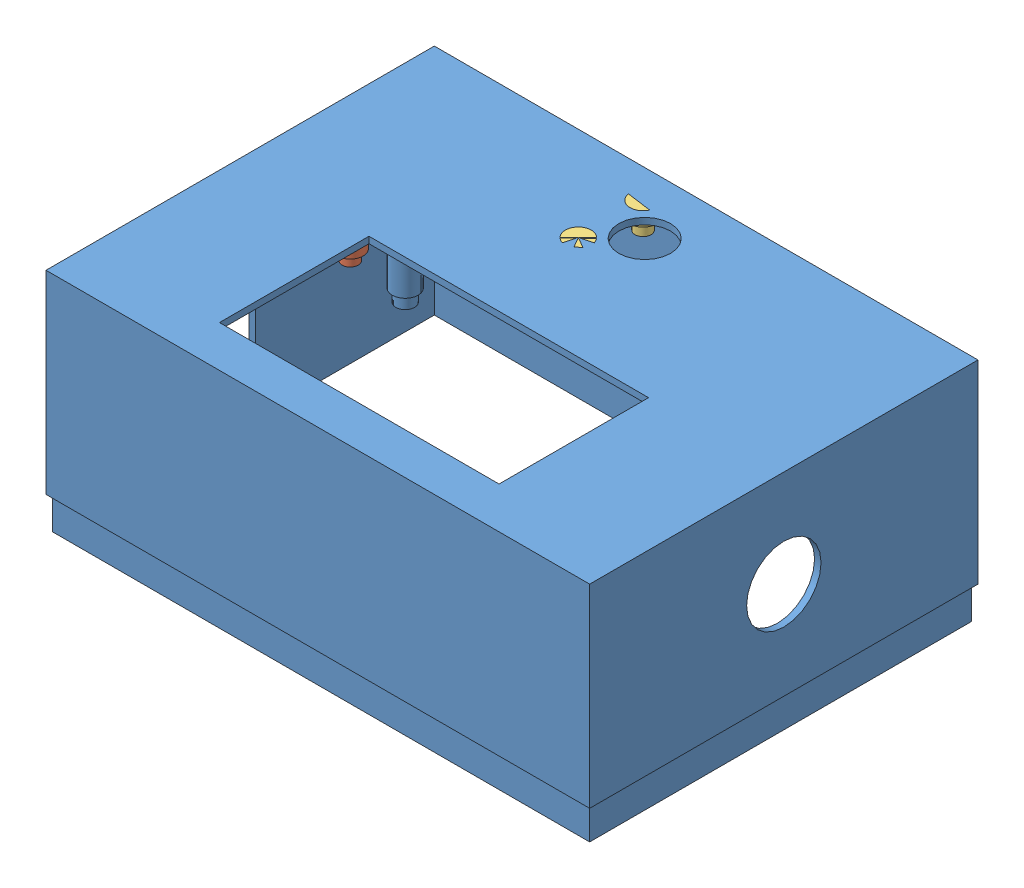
SolidWorks assembly Case.SLDASM, configuration Default (file format 10000). Lengths in mm.
Overall size (84 35 60).
9 component instances, 3 part files, 8 mates.
Components (placement in the parent):
- UpperCase-1: UpperCase.SLDPRT [Default] at (-8.0883 45.2445 103.5887) size (84 35 60)
- Screw-1: Screw.SLDPRT [Default] at (60.4117 74.2445 99.0887) x (-1 0 0) z (0 0 1) size (4 5.7 4)
- Screw-2: Screw.SLDPRT [Default] at (60.4117 74.2445 72.0887) x (-1 0 0) z (0 0 1) size (4 5.7 4)
- Screw-3: Screw.SLDPRT [Default] at (7.4117 74.2445 72.0887) x (-1 0 0) z (0 0 1) size (4 5.7 4)
- Screw-4: Screw.SLDPRT [Default] at (7.4117 74.2445 99.0887) x (-1 0 0) z (0 0 1) size (4 5.7 4)
- Screw1 -1: Screw1 .SLDPRT [Default] at (28.6617 75.2445 48.0887) x (-1 0 0) z (0 0 1) size (4 4 4)
- Screw1 -2: Screw1 .SLDPRT [Default] at (39.1617 75.2445 48.0887) x (-1 0 0) z (0 0 1) size (4 4 4)
- Screw1 -3: Screw1 .SLDPRT [Default] at (39.1617 75.2445 58.0887) x (-1 0 0) z (0 0 1) size (4 4 4)
- Screw1 -5: Screw1 .SLDPRT [Default] at (28.6617 75.2445 58.0887) x (-1 0 0) z (0 0 1) size (4 4 4)
Mates (geometry in assembly coordinates):
- Coincident4: coincident: point of Screw-3; point of UpperCase-1
- Coincident8: coincident: point of UpperCase-1; point of Screw1 -3
- Coincident9: coincident: point of UpperCase-1; point of Screw1 -1
- Coincident10: coincident: point of UpperCase-1; point of Screw1 -5
- Coincident11: coincident: point of UpperCase-1; point of Screw1 -2
- Coincident12: coincident: point of UpperCase-1; point of Screw-4
- Coincident13: coincident: point of UpperCase-1; point of Screw-1
- Coincident14: coincident: point of UpperCase-1; point of Screw-2
